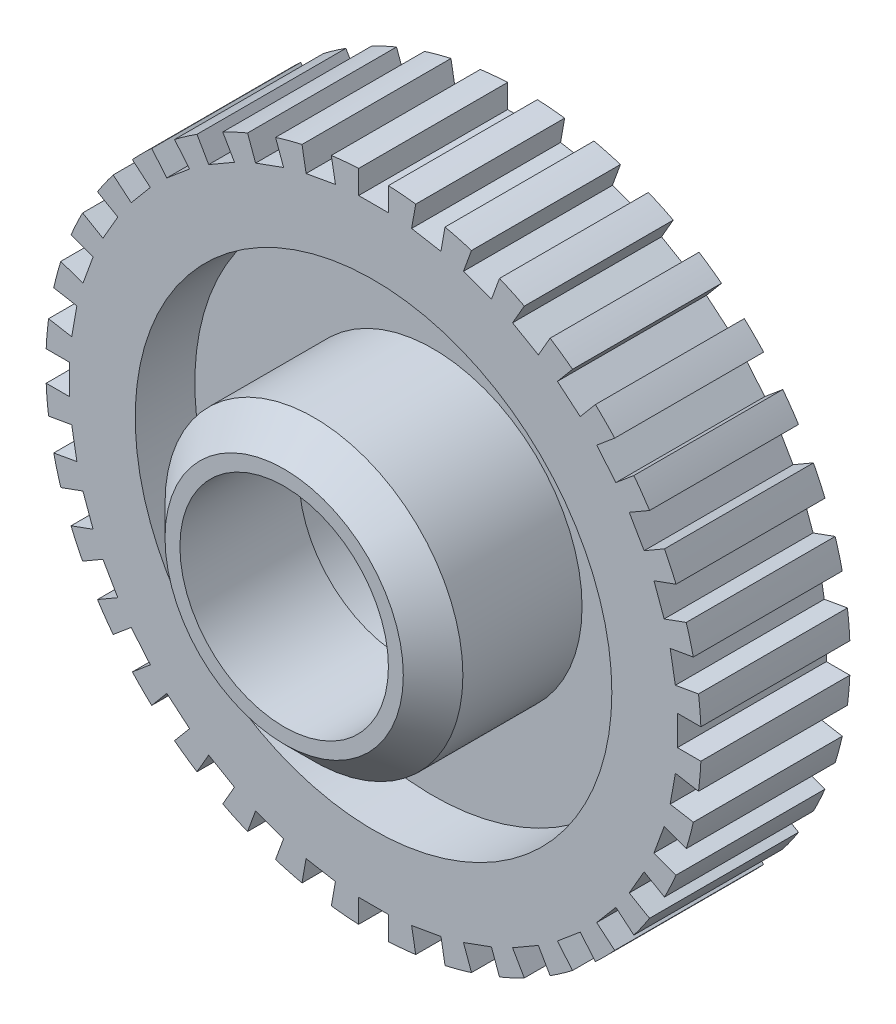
from build123d import *

# Parameters (mm, degrees)
ESQUISSE1_R                  = 11
BASE_EXTRUSION_DEPTH         = 5
ESQUISSE2_R                  = 8
ENL_V_MAT_EXTRU_1_DEPTH      = 2
ESQUISSE3_R                  = 5
BOSS_EXTRU_1_DEPTH           = 5
ENL_V_START                  = -2
ESQUISSE4_R                  = 8
ENL_V_MAT_EXTRU_2_DEPTH      = 2
BOSS_EXTRU_2_START           = 2
ESQUISSE5_R                  = 5
BOSS_EXTRU_2_DEPTH           = 2
ESQUISSE6_R                  = 3.5
ENL_V_MAT_EXTRU_3_DEPTH      = 22
ESQUISSE8_R                  = 4
ENL_V_MAT_EXTRU_5_DEPTH      = 4
CHANFREIN1_SIZE              = 1
ESQUISSE9_W                  = 1
ESQUISSE9_H                  = 1.4
ENL_V_MAT_EXTRU_6_DEPTH      = 14
R_P_TITION_CIRCULAIRE1_COUNT = 36


with BuildPart() as part:
    # Esquisse1 → Base-Extrusion (new body)
    with BuildSketch(Plane.XY):
        Circle(ESQUISSE1_R)
    extrude(amount=BASE_EXTRUSION_DEPTH)

    # Esquisse2 → Enl_v. mat.-Extru.1 (cut)
    with BuildSketch(Plane.XY.offset(5)):
        Circle(ESQUISSE2_R)
    extrude(amount=-ENL_V_MAT_EXTRU_1_DEPTH, mode=Mode.SUBTRACT)

    # Esquisse3 → Boss.-Extru.1 (add)
    with BuildSketch(Plane.XY.offset(3)):
        Circle(ESQUISSE3_R)
    extrude(amount=BOSS_EXTRU_1_DEPTH)

    # Esquisse4 → Enl_v. mat.-Extru.2 (cut)
    with BuildSketch(Plane(origin=(0, 0, 0), x_dir=(-1, 0, 0), z_dir=(0, 0, -1)).offset(ENL_V_START)):
        with Locations(Location((0, 0, 0), (0, 0, 180))):
            Circle(ESQUISSE4_R)
    extrude(amount=ENL_V_MAT_EXTRU_2_DEPTH, mode=Mode.SUBTRACT)

    # Esquisse5 → Boss.-Extru.2 (add)
    with BuildSketch(Plane(origin=(0, 0, 2), x_dir=(-1, 0, 0), z_dir=(0, 0, -1)).offset(BOSS_EXTRU_2_START)):
        with Locations(Location((0, 0, 0), (0, 0, 180))):
            Circle(ESQUISSE5_R)
    extrude(amount=-BOSS_EXTRU_2_DEPTH)

    # Esquisse6 → Enl_v. mat.-Extru.3 (cut)
    with BuildSketch(Plane(origin=(0, 0, 0), x_dir=(-1, 0, 0), z_dir=(0, 0, -1))):
        Circle(ESQUISSE6_R)
    extrude(amount=-ENL_V_MAT_EXTRU_3_DEPTH, mode=Mode.SUBTRACT)

    # Esquisse8 → Enl_v. mat.-Extru.5 (cut)
    with BuildSketch(Plane(origin=(0, 0, 0), x_dir=(-1, 0, 0), z_dir=(0, 0, -1))):
        Circle(ESQUISSE8_R)
    extrude(amount=-ENL_V_MAT_EXTRU_5_DEPTH, mode=Mode.SUBTRACT)

    # Chanfrein1
    chanfrein1_edges = [part.edges().sort_by_distance(p)[0] for p in [
        (-5, 0, 8),
    ]]
    chamfer(chanfrein1_edges, length=CHANFREIN1_SIZE)

    # Esquisse9 → Enl_v. mat.-Extru.6 (cut)
    with BuildSketch(Plane(origin=(0, 0, 0), x_dir=(-1, 0, 0), z_dir=(0, 0, -1))):
        with Locations((0, 10.9)):
            Rectangle(ESQUISSE9_W, ESQUISSE9_H)
    enl_v_mat_extru_6 = extrude(amount=-ENL_V_MAT_EXTRU_6_DEPTH, mode=Mode.SUBTRACT)

    # R_p_tition circulaire1: Enl_v. mat.-Extru.6 ×36 about axis
    r_p_tition_circulaire1_axis = Axis((0, 0, 0), (0, 0, -1))
    for i in range(1, R_P_TITION_CIRCULAIRE1_COUNT):
        add(enl_v_mat_extru_6.rotate(r_p_tition_circulaire1_axis, i * 360 / R_P_TITION_CIRCULAIRE1_COUNT), mode=Mode.SUBTRACT)


solid = part.part
